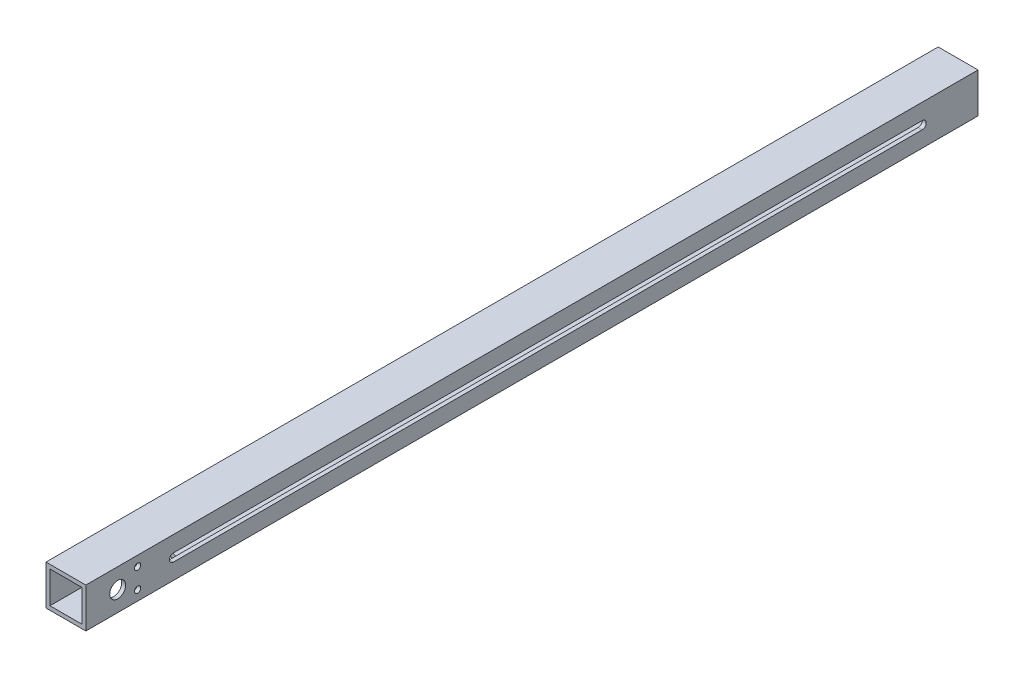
ISO-10303-21;
HEADER;
FILE_DESCRIPTION(('STEP AP214'),'2;1');
FILE_NAME('part.step','',(''),(''),'','','');
FILE_SCHEMA(('AUTOMOTIVE_DESIGN { 1 0 10303 214 1 1 1 1 }'));
ENDSEC;
DATA;
#1=APPLICATION_CONTEXT('core data for automotive mechanical design processes');
#2=APPLICATION_PROTOCOL_DEFINITION('international standard','automotive_design',2000,#1);
#3=PRODUCT_CONTEXT('',#1,'mechanical');
#4=PRODUCT('Part','Part','',(#3));
#5=PRODUCT_RELATED_PRODUCT_CATEGORY('part','',(#4));
#6=PRODUCT_DEFINITION_FORMATION('','',#4);
#7=PRODUCT_DEFINITION_CONTEXT('part definition',#1,'design');
#8=PRODUCT_DEFINITION('design','',#6,#7);
#9=PRODUCT_DEFINITION_SHAPE('','',#8);
#10=(LENGTH_UNIT() NAMED_UNIT(*) SI_UNIT(.MILLI.,.METRE.));
#11=(NAMED_UNIT(*) PLANE_ANGLE_UNIT() SI_UNIT($,.RADIAN.));
#12=(NAMED_UNIT(*) SI_UNIT($,.STERADIAN.) SOLID_ANGLE_UNIT());
#13=UNCERTAINTY_MEASURE_WITH_UNIT(LENGTH_MEASURE(1.E-05),#10,'distance_accuracy_value','');
#14=(GEOMETRIC_REPRESENTATION_CONTEXT(3) GLOBAL_UNCERTAINTY_ASSIGNED_CONTEXT((#13)) GLOBAL_UNIT_ASSIGNED_CONTEXT((#10,
#11,#12)) REPRESENTATION_CONTEXT('',''));
#15=CARTESIAN_POINT('',(0.,0.,0.));
#16=DIRECTION('',(0.,0.,1.));
#17=DIRECTION('',(1.,0.,0.));
#18=AXIS2_PLACEMENT_3D('',#15,#16,#17);
#19=CARTESIAN_POINT('',(-15.875,-15.875,-711.2));
#20=DIRECTION('',(-1.,0.,0.));
#21=DIRECTION('',(0.,0.,1.));
#22=AXIS2_PLACEMENT_3D('',#19,#20,#21);
#23=PLANE('',#22);
#24=DIRECTION('',(0.,0.,-1.));
#25=VECTOR('',#24,1.);
#26=CARTESIAN_POINT('',(-15.875,12.7,-711.2));
#27=LINE('',#26,#25);
#28=CARTESIAN_POINT('',(-15.875,12.7,-628.65));
#29=VERTEX_POINT('',#28);
#30=CARTESIAN_POINT('',(-15.875,12.7,-711.2));
#31=VERTEX_POINT('',#30);
#32=EDGE_CURVE('E276',#29,#31,#27,.T.);
#33=ORIENTED_EDGE('',*,*,#32,.F.);
#34=CARTESIAN_POINT('',(-15.875,6.35,-628.65));
#35=DIRECTION('',(-1.,0.,0.));
#36=DIRECTION('',(0.,0.,1.));
#37=AXIS2_PLACEMENT_3D('',#34,#35,#36);
#38=CIRCLE('',#37,6.35);
#39=CARTESIAN_POINT('',(-15.875,6.35,-622.3));
#40=VERTEX_POINT('',#39);
#41=EDGE_CURVE('E472',#29,#40,#38,.F.);
#42=ORIENTED_EDGE('',*,*,#41,.T.);
#43=DIRECTION('',(0.,1.,0.));
#44=VECTOR('',#43,1.);
#45=CARTESIAN_POINT('',(-15.875,12.7,-622.3));
#46=LINE('',#45,#44);
#47=CARTESIAN_POINT('',(-15.875,-6.35,-622.3));
#48=VERTEX_POINT('',#47);
#49=EDGE_CURVE('E279',#48,#40,#46,.T.);
#50=ORIENTED_EDGE('',*,*,#49,.F.);
#51=CARTESIAN_POINT('',(-15.875,-6.35,-628.65));
#52=DIRECTION('',(-1.,0.,0.));
#53=DIRECTION('',(0.,0.,1.));
#54=AXIS2_PLACEMENT_3D('',#51,#52,#53);
#55=CIRCLE('',#54,6.35);
#56=CARTESIAN_POINT('',(-15.875,-12.7,-628.65));
#57=VERTEX_POINT('',#56);
#58=EDGE_CURVE('E47',#48,#57,#55,.F.);
#59=ORIENTED_EDGE('',*,*,#58,.T.);
#60=DIRECTION('',(0.,0.,1.));
#61=VECTOR('',#60,1.);
#62=CARTESIAN_POINT('',(-15.875,-12.7,-711.2));
#63=LINE('',#62,#61);
#64=CARTESIAN_POINT('',(-15.875,-12.7,-711.2));
#65=VERTEX_POINT('',#64);
#66=EDGE_CURVE('E237',#65,#57,#63,.T.);
#67=ORIENTED_EDGE('',*,*,#66,.F.);
#68=DIRECTION('',(0.,-1.,0.));
#69=VECTOR('',#68,1.);
#70=CARTESIAN_POINT('',(-15.875,-15.875,-711.2));
#71=LINE('',#70,#69);
#72=CARTESIAN_POINT('',(-15.875,-15.875,-711.2));
#73=VERTEX_POINT('',#72);
#74=EDGE_CURVE('E410',#65,#73,#71,.T.);
#75=ORIENTED_EDGE('',*,*,#74,.T.);
#76=DIRECTION('',(0.,0.,1.));
#77=VECTOR('',#76,1.);
#78=CARTESIAN_POINT('',(-15.875,-15.875,-711.2));
#79=LINE('',#78,#77);
#80=CARTESIAN_POINT('',(-15.875,-15.875,0.));
#81=VERTEX_POINT('',#80);
#82=EDGE_CURVE('E422',#73,#81,#79,.T.);
#83=ORIENTED_EDGE('',*,*,#82,.T.);
#84=DIRECTION('',(0.,-1.,0.));
#85=VECTOR('',#84,1.);
#86=CARTESIAN_POINT('',(-15.875,-15.875,0.));
#87=LINE('',#86,#85);
#88=CARTESIAN_POINT('',(-15.875,15.875,0.));
#89=VERTEX_POINT('',#88);
#90=EDGE_CURVE('E396',#89,#81,#87,.T.);
#91=ORIENTED_EDGE('',*,*,#90,.F.);
#92=DIRECTION('',(0.,0.,1.));
#93=VECTOR('',#92,1.);
#94=CARTESIAN_POINT('',(-15.875,15.875,-711.2));
#95=LINE('',#94,#93);
#96=CARTESIAN_POINT('',(-15.875,15.875,-711.2));
#97=VERTEX_POINT('',#96);
#98=EDGE_CURVE('E438',#97,#89,#95,.T.);
#99=ORIENTED_EDGE('',*,*,#98,.F.);
#100=EDGE_CURVE('E405',#97,#31,#71,.T.);
#101=ORIENTED_EDGE('',*,*,#100,.T.);
#102=EDGE_LOOP('',(#33,#42,#50,#59,#67,#75,#83,#91,#99,#101));
#103=FACE_BOUND('',#102,.T.);
#104=CARTESIAN_POINT('',(-15.875,-7.9375,-41.275));
#105=DIRECTION('',(1.,0.,0.));
#106=DIRECTION('',(0.,1.,0.));
#107=AXIS2_PLACEMENT_3D('',#104,#105,#106);
#108=CIRCLE('',#107,2.4892);
#109=CARTESIAN_POINT('',(-15.875,-5.4483,-41.275));
#110=VERTEX_POINT('',#109);
#111=EDGE_CURVE('E329',#110,#110,#108,.T.);
#112=ORIENTED_EDGE('',*,*,#111,.T.);
#113=EDGE_LOOP('',(#112));
#114=FACE_BOUND('',#113,.T.);
#115=CARTESIAN_POINT('',(-15.875,7.9375,-41.275));
#116=DIRECTION('',(1.,0.,0.));
#117=DIRECTION('',(0.,1.,0.));
#118=AXIS2_PLACEMENT_3D('',#115,#116,#117);
#119=CIRCLE('',#118,2.4892);
#120=CARTESIAN_POINT('',(-15.875,10.4267,-41.275));
#121=VERTEX_POINT('',#120);
#122=EDGE_CURVE('E342',#121,#121,#119,.T.);
#123=ORIENTED_EDGE('',*,*,#122,.T.);
#124=EDGE_LOOP('',(#123));
#125=FACE_BOUND('',#124,.T.);
#126=CARTESIAN_POINT('',(-15.875,0.,-25.4));
#127=DIRECTION('',(1.,0.,0.));
#128=DIRECTION('',(0.,1.,0.));
#129=AXIS2_PLACEMENT_3D('',#126,#127,#128);
#130=CIRCLE('',#129,6.35);
#131=CARTESIAN_POINT('',(-15.875,6.35,-25.4));
#132=VERTEX_POINT('',#131);
#133=EDGE_CURVE('E355',#132,#132,#130,.T.);
#134=ORIENTED_EDGE('',*,*,#133,.T.);
#135=EDGE_LOOP('',(#134));
#136=FACE_BOUND('',#135,.T.);
#137=ADVANCED_FACE('F38',(#103,#114,#125,#136),#23,.T.);
#138=CARTESIAN_POINT('',(-15.875,15.875,-711.2));
#139=DIRECTION('',(0.,1.,0.));
#140=DIRECTION('',(0.,0.,1.));
#141=AXIS2_PLACEMENT_3D('',#138,#139,#140);
#142=PLANE('',#141);
#143=DIRECTION('',(-1.,0.,0.));
#144=VECTOR('',#143,1.);
#145=CARTESIAN_POINT('',(-15.875,15.875,0.));
#146=LINE('',#145,#144);
#147=CARTESIAN_POINT('',(15.875,15.875,0.));
#148=VERTEX_POINT('',#147);
#149=EDGE_CURVE('E434',#148,#89,#146,.T.);
#150=ORIENTED_EDGE('',*,*,#149,.F.);
#151=DIRECTION('',(0.,0.,1.));
#152=VECTOR('',#151,1.);
#153=CARTESIAN_POINT('',(15.875,15.875,-711.2));
#154=LINE('',#153,#152);
#155=CARTESIAN_POINT('',(15.875,15.875,-711.2));
#156=VERTEX_POINT('',#155);
#157=EDGE_CURVE('E442',#156,#148,#154,.T.);
#158=ORIENTED_EDGE('',*,*,#157,.F.);
#159=DIRECTION('',(-1.,0.,0.));
#160=VECTOR('',#159,1.);
#161=CARTESIAN_POINT('',(-15.875,15.875,-711.2));
#162=LINE('',#161,#160);
#163=EDGE_CURVE('E418',#156,#97,#162,.T.);
#164=ORIENTED_EDGE('',*,*,#163,.T.);
#165=ORIENTED_EDGE('',*,*,#98,.T.);
#166=EDGE_LOOP('',(#150,#158,#164,#165));
#167=FACE_BOUND('',#166,.T.);
#168=ADVANCED_FACE('F511',(#167),#142,.T.);
#169=CARTESIAN_POINT('',(15.875,-15.875,-711.2));
#170=DIRECTION('',(1.,0.,0.));
#171=DIRECTION('',(0.,1.,0.));
#172=AXIS2_PLACEMENT_3D('',#169,#170,#171);
#173=PLANE('',#172);
#174=CARTESIAN_POINT('',(15.875,0.,-69.85));
#175=DIRECTION('',(1.,0.,0.));
#176=DIRECTION('',(0.,1.,0.));
#177=AXIS2_PLACEMENT_3D('',#174,#175,#176);
#178=CIRCLE('',#177,3.175);
#179=CARTESIAN_POINT('',(15.875,3.175,-69.85));
#180=VERTEX_POINT('',#179);
#181=CARTESIAN_POINT('',(15.875,-3.175,-69.85));
#182=VERTEX_POINT('',#181);
#183=EDGE_CURVE('E275',#180,#182,#178,.T.);
#184=ORIENTED_EDGE('',*,*,#183,.F.);
#185=DIRECTION('',(0.,0.,1.));
#186=VECTOR('',#185,1.);
#187=CARTESIAN_POINT('',(15.875,3.175,-69.85));
#188=LINE('',#187,#186);
#189=CARTESIAN_POINT('',(15.875,3.175,-666.75));
#190=VERTEX_POINT('',#189);
#191=EDGE_CURVE('E290',#190,#180,#188,.T.);
#192=ORIENTED_EDGE('',*,*,#191,.F.);
#193=CARTESIAN_POINT('',(15.875,0.,-666.75));
#194=DIRECTION('',(1.,0.,0.));
#195=DIRECTION('',(0.,1.,0.));
#196=AXIS2_PLACEMENT_3D('',#193,#194,#195);
#197=CIRCLE('',#196,3.175);
#198=CARTESIAN_POINT('',(15.875,-3.175,-666.75));
#199=VERTEX_POINT('',#198);
#200=EDGE_CURVE('E309',#199,#190,#197,.T.);
#201=ORIENTED_EDGE('',*,*,#200,.F.);
#202=DIRECTION('',(0.,0.,-1.));
#203=VECTOR('',#202,1.);
#204=CARTESIAN_POINT('',(15.875,-3.175,-69.85));
#205=LINE('',#204,#203);
#206=EDGE_CURVE('E305',#182,#199,#205,.T.);
#207=ORIENTED_EDGE('',*,*,#206,.F.);
#208=EDGE_LOOP('',(#184,#192,#201,#207));
#209=FACE_BOUND('',#208,.T.);
#210=CARTESIAN_POINT('',(15.875,-7.9375,-41.275));
#211=DIRECTION('',(1.,0.,0.));
#212=DIRECTION('',(0.,1.,0.));
#213=AXIS2_PLACEMENT_3D('',#210,#211,#212);
#214=CIRCLE('',#213,2.4892);
#215=CARTESIAN_POINT('',(15.875,-5.44830000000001,-41.275));
#216=VERTEX_POINT('',#215);
#217=EDGE_CURVE('E319',#216,#216,#214,.T.);
#218=ORIENTED_EDGE('',*,*,#217,.F.);
#219=EDGE_LOOP('',(#218));
#220=FACE_BOUND('',#219,.T.);
#221=CARTESIAN_POINT('',(15.875,7.9375,-41.275));
#222=DIRECTION('',(1.,0.,0.));
#223=DIRECTION('',(0.,1.,0.));
#224=AXIS2_PLACEMENT_3D('',#221,#222,#223);
#225=CIRCLE('',#224,2.4892);
#226=CARTESIAN_POINT('',(15.875,10.4267,-41.275));
#227=VERTEX_POINT('',#226);
#228=EDGE_CURVE('E341',#227,#227,#225,.T.);
#229=ORIENTED_EDGE('',*,*,#228,.F.);
#230=EDGE_LOOP('',(#229));
#231=FACE_BOUND('',#230,.T.);
#232=CARTESIAN_POINT('',(15.875,0.,-25.4));
#233=DIRECTION('',(1.,0.,0.));
#234=DIRECTION('',(0.,1.,0.));
#235=AXIS2_PLACEMENT_3D('',#232,#233,#234);
#236=CIRCLE('',#235,6.35);
#237=CARTESIAN_POINT('',(15.875,6.35,-25.4));
#238=VERTEX_POINT('',#237);
#239=EDGE_CURVE('E354',#238,#238,#236,.T.);
#240=ORIENTED_EDGE('',*,*,#239,.F.);
#241=EDGE_LOOP('',(#240));
#242=FACE_BOUND('',#241,.T.);
#243=DIRECTION('',(0.,1.,0.));
#244=VECTOR('',#243,1.);
#245=CARTESIAN_POINT('',(15.875,-15.875,0.));
#246=LINE('',#245,#244);
#247=CARTESIAN_POINT('',(15.875,-15.875,0.));
#248=VERTEX_POINT('',#247);
#249=EDGE_CURVE('E430',#248,#148,#246,.T.);
#250=ORIENTED_EDGE('',*,*,#249,.F.);
#251=DIRECTION('',(0.,0.,1.));
#252=VECTOR('',#251,1.);
#253=CARTESIAN_POINT('',(15.875,-15.875,-711.2));
#254=LINE('',#253,#252);
#255=CARTESIAN_POINT('',(15.875,-15.875,-711.2));
#256=VERTEX_POINT('',#255);
#257=EDGE_CURVE('E445',#256,#248,#254,.T.);
#258=ORIENTED_EDGE('',*,*,#257,.F.);
#259=DIRECTION('',(0.,1.,0.));
#260=VECTOR('',#259,1.);
#261=CARTESIAN_POINT('',(15.875,-15.875,-711.2));
#262=LINE('',#261,#260);
#263=EDGE_CURVE('E414',#256,#156,#262,.T.);
#264=ORIENTED_EDGE('',*,*,#263,.T.);
#265=ORIENTED_EDGE('',*,*,#157,.T.);
#266=EDGE_LOOP('',(#250,#258,#264,#265));
#267=FACE_BOUND('',#266,.T.);
#268=ADVANCED_FACE('F492',(#209,#220,#231,#242,#267),#173,.T.);
#269=CARTESIAN_POINT('',(-15.875,-15.875,-711.2));
#270=DIRECTION('',(0.,-1.,0.));
#271=DIRECTION('',(0.,0.,-1.));
#272=AXIS2_PLACEMENT_3D('',#269,#270,#271);
#273=PLANE('',#272);
#274=CARTESIAN_POINT('',(0.,-15.875,-25.4));
#275=DIRECTION('',(0.,-1.,0.));
#276=DIRECTION('',(0.,0.,-1.));
#277=AXIS2_PLACEMENT_3D('',#274,#275,#276);
#278=CIRCLE('',#277,8.89);
#279=CARTESIAN_POINT('',(8.89,-15.875,-25.4));
#280=VERTEX_POINT('',#279);
#281=CARTESIAN_POINT('',(-8.89,-15.875,-25.4));
#282=VERTEX_POINT('',#281);
#283=EDGE_CURVE('E222',#280,#282,#278,.T.);
#284=ORIENTED_EDGE('',*,*,#283,.F.);
#285=DIRECTION('',(0.,0.,1.));
#286=VECTOR('',#285,1.);
#287=CARTESIAN_POINT('',(8.89,-15.875,-25.4));
#288=LINE('',#287,#286);
#289=CARTESIAN_POINT('',(8.89000000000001,-15.875,-76.2));
#290=VERTEX_POINT('',#289);
#291=EDGE_CURVE('E228',#290,#280,#288,.T.);
#292=ORIENTED_EDGE('',*,*,#291,.F.);
#293=CARTESIAN_POINT('',(0.,-15.875,-76.2));
#294=DIRECTION('',(0.,-1.,0.));
#295=DIRECTION('',(0.,0.,-1.));
#296=AXIS2_PLACEMENT_3D('',#293,#294,#295);
#297=CIRCLE('',#296,8.89);
#298=CARTESIAN_POINT('',(-8.88999999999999,-15.875,-76.2));
#299=VERTEX_POINT('',#298);
#300=EDGE_CURVE('E257',#299,#290,#297,.T.);
#301=ORIENTED_EDGE('',*,*,#300,.F.);
#302=DIRECTION('',(0.,0.,-1.));
#303=VECTOR('',#302,1.);
#304=CARTESIAN_POINT('',(-8.89,-15.875,-25.4));
#305=LINE('',#304,#303);
#306=EDGE_CURVE('E248',#282,#299,#305,.T.);
#307=ORIENTED_EDGE('',*,*,#306,.F.);
#308=EDGE_LOOP('',(#284,#292,#301,#307));
#309=FACE_BOUND('',#308,.T.);
#310=DIRECTION('',(1.,0.,0.));
#311=VECTOR('',#310,1.);
#312=CARTESIAN_POINT('',(-15.875,-15.875,0.));
#313=LINE('',#312,#311);
#314=EDGE_CURVE('E426',#81,#248,#313,.T.);
#315=ORIENTED_EDGE('',*,*,#314,.F.);
#316=ORIENTED_EDGE('',*,*,#82,.F.);
#317=DIRECTION('',(1.,0.,0.));
#318=VECTOR('',#317,1.);
#319=CARTESIAN_POINT('',(-15.875,-15.875,-711.2));
#320=LINE('',#319,#318);
#321=EDGE_CURVE('E409',#73,#256,#320,.T.);
#322=ORIENTED_EDGE('',*,*,#321,.T.);
#323=ORIENTED_EDGE('',*,*,#257,.T.);
#324=EDGE_LOOP('',(#315,#316,#322,#323));
#325=FACE_BOUND('',#324,.T.);
#326=ADVANCED_FACE('F488',(#309,#325),#273,.T.);
#327=CARTESIAN_POINT('',(0.,0.,-711.2));
#328=DIRECTION('',(0.,0.,-1.));
#329=DIRECTION('',(-1.,0.,0.));
#330=AXIS2_PLACEMENT_3D('',#327,#328,#329);
#331=PLANE('',#330);
#332=DIRECTION('',(-1.,0.,0.));
#333=VECTOR('',#332,1.);
#334=CARTESIAN_POINT('',(-12.7,12.7,-711.2));
#335=LINE('',#334,#333);
#336=CARTESIAN_POINT('',(12.7,12.7,-711.2));
#337=VERTEX_POINT('',#336);
#338=EDGE_CURVE('E371',#337,#31,#335,.T.);
#339=ORIENTED_EDGE('',*,*,#338,.T.);
#340=ORIENTED_EDGE('',*,*,#100,.F.);
#341=ORIENTED_EDGE('',*,*,#163,.F.);
#342=ORIENTED_EDGE('',*,*,#263,.F.);
#343=ORIENTED_EDGE('',*,*,#321,.F.);
#344=ORIENTED_EDGE('',*,*,#74,.F.);
#345=DIRECTION('',(1.,0.,0.));
#346=VECTOR('',#345,1.);
#347=CARTESIAN_POINT('',(-12.7,-12.7,-711.2));
#348=LINE('',#347,#346);
#349=CARTESIAN_POINT('',(12.7,-12.7,-711.2));
#350=VERTEX_POINT('',#349);
#351=EDGE_CURVE('E376',#65,#350,#348,.T.);
#352=ORIENTED_EDGE('',*,*,#351,.T.);
#353=DIRECTION('',(0.,1.,0.));
#354=VECTOR('',#353,1.);
#355=CARTESIAN_POINT('',(12.7,-12.7,-711.2));
#356=LINE('',#355,#354);
#357=EDGE_CURVE('E367',#350,#337,#356,.T.);
#358=ORIENTED_EDGE('',*,*,#357,.T.);
#359=EDGE_LOOP('',(#339,#340,#341,#342,#343,#344,#352,#358));
#360=FACE_BOUND('',#359,.T.);
#361=ADVANCED_FACE('F491',(#360),#331,.T.);
#362=CARTESIAN_POINT('',(0.,0.,0.));
#363=DIRECTION('',(0.,0.,-1.));
#364=DIRECTION('',(-1.,0.,0.));
#365=AXIS2_PLACEMENT_3D('',#362,#363,#364);
#366=PLANE('',#365);
#367=DIRECTION('',(-1.,0.,0.));
#368=VECTOR('',#367,1.);
#369=CARTESIAN_POINT('',(-12.7,12.7,0.));
#370=LINE('',#369,#368);
#371=CARTESIAN_POINT('',(12.7,12.7,0.));
#372=VERTEX_POINT('',#371);
#373=CARTESIAN_POINT('',(-12.7,12.7,0.));
#374=VERTEX_POINT('',#373);
#375=EDGE_CURVE('E383',#372,#374,#370,.T.);
#376=ORIENTED_EDGE('',*,*,#375,.F.);
#377=DIRECTION('',(0.,1.,0.));
#378=VECTOR('',#377,1.);
#379=CARTESIAN_POINT('',(12.7,-12.7,0.));
#380=LINE('',#379,#378);
#381=CARTESIAN_POINT('',(12.7,-12.7,0.));
#382=VERTEX_POINT('',#381);
#383=EDGE_CURVE('E366',#382,#372,#380,.T.);
#384=ORIENTED_EDGE('',*,*,#383,.F.);
#385=DIRECTION('',(1.,0.,0.));
#386=VECTOR('',#385,1.);
#387=CARTESIAN_POINT('',(-12.7,-12.7,0.));
#388=LINE('',#387,#386);
#389=CARTESIAN_POINT('',(-12.7,-12.7,0.));
#390=VERTEX_POINT('',#389);
#391=EDGE_CURVE('E372',#390,#382,#388,.T.);
#392=ORIENTED_EDGE('',*,*,#391,.F.);
#393=DIRECTION('',(0.,-1.,0.));
#394=VECTOR('',#393,1.);
#395=CARTESIAN_POINT('',(-12.7,-12.7,0.));
#396=LINE('',#395,#394);
#397=EDGE_CURVE('E387',#374,#390,#396,.T.);
#398=ORIENTED_EDGE('',*,*,#397,.F.);
#399=EDGE_LOOP('',(#376,#384,#392,#398));
#400=FACE_BOUND('',#399,.T.);
#401=ORIENTED_EDGE('',*,*,#90,.T.);
#402=ORIENTED_EDGE('',*,*,#314,.T.);
#403=ORIENTED_EDGE('',*,*,#249,.T.);
#404=ORIENTED_EDGE('',*,*,#149,.T.);
#405=EDGE_LOOP('',(#401,#402,#403,#404));
#406=FACE_BOUND('',#405,.T.);
#407=ADVANCED_FACE('F500',(#400,#406),#366,.F.);
#408=CARTESIAN_POINT('',(12.7,-12.7,-711.2));
#409=DIRECTION('',(1.,0.,0.));
#410=DIRECTION('',(0.,0.,-1.));
#411=AXIS2_PLACEMENT_3D('',#408,#409,#410);
#412=PLANE('',#411);
#413=DIRECTION('',(0.,0.,1.));
#414=VECTOR('',#413,1.);
#415=CARTESIAN_POINT('',(12.7,3.175,-69.85));
#416=LINE('',#415,#414);
#417=CARTESIAN_POINT('',(12.7,3.175,-666.75));
#418=VERTEX_POINT('',#417);
#419=CARTESIAN_POINT('',(12.7,3.175,-69.85));
#420=VERTEX_POINT('',#419);
#421=EDGE_CURVE('E298',#418,#420,#416,.T.);
#422=ORIENTED_EDGE('',*,*,#421,.T.);
#423=CARTESIAN_POINT('',(12.7,0.,-69.85));
#424=DIRECTION('',(1.,0.,0.));
#425=DIRECTION('',(0.,1.,0.));
#426=AXIS2_PLACEMENT_3D('',#423,#424,#425);
#427=CIRCLE('',#426,3.175);
#428=CARTESIAN_POINT('',(12.7,-3.175,-69.85));
#429=VERTEX_POINT('',#428);
#430=EDGE_CURVE('E285',#420,#429,#427,.T.);
#431=ORIENTED_EDGE('',*,*,#430,.T.);
#432=DIRECTION('',(0.,0.,-1.));
#433=VECTOR('',#432,1.);
#434=CARTESIAN_POINT('',(12.7,-3.175,-69.85));
#435=LINE('',#434,#433);
#436=CARTESIAN_POINT('',(12.7,-3.175,-666.75));
#437=VERTEX_POINT('',#436);
#438=EDGE_CURVE('E289',#429,#437,#435,.T.);
#439=ORIENTED_EDGE('',*,*,#438,.T.);
#440=CARTESIAN_POINT('',(12.7,0.,-666.75));
#441=DIRECTION('',(1.,0.,0.));
#442=DIRECTION('',(0.,1.,0.));
#443=AXIS2_PLACEMENT_3D('',#440,#441,#442);
#444=CIRCLE('',#443,3.175);
#445=EDGE_CURVE('E294',#437,#418,#444,.T.);
#446=ORIENTED_EDGE('',*,*,#445,.T.);
#447=EDGE_LOOP('',(#422,#431,#439,#446));
#448=FACE_BOUND('',#447,.T.);
#449=CARTESIAN_POINT('',(12.7,-7.9375,-41.275));
#450=DIRECTION('',(1.,0.,0.));
#451=DIRECTION('',(0.,0.,-1.));
#452=AXIS2_PLACEMENT_3D('',#449,#450,#451);
#453=CIRCLE('',#452,2.4892);
#454=CARTESIAN_POINT('',(12.7,-7.9375,-43.7642));
#455=VERTEX_POINT('',#454);
#456=EDGE_CURVE('E337',#455,#455,#453,.T.);
#457=ORIENTED_EDGE('',*,*,#456,.T.);
#458=EDGE_LOOP('',(#457));
#459=FACE_BOUND('',#458,.T.);
#460=CARTESIAN_POINT('',(12.7,7.9375,-41.275));
#461=DIRECTION('',(1.,0.,0.));
#462=DIRECTION('',(0.,0.,-1.));
#463=AXIS2_PLACEMENT_3D('',#460,#461,#462);
#464=CIRCLE('',#463,2.4892);
#465=CARTESIAN_POINT('',(12.7,7.9375,-43.7642));
#466=VERTEX_POINT('',#465);
#467=EDGE_CURVE('E350',#466,#466,#464,.T.);
#468=ORIENTED_EDGE('',*,*,#467,.T.);
#469=EDGE_LOOP('',(#468));
#470=FACE_BOUND('',#469,.T.);
#471=CARTESIAN_POINT('',(12.7,0.,-25.4));
#472=DIRECTION('',(1.,0.,0.));
#473=DIRECTION('',(0.,0.,-1.));
#474=AXIS2_PLACEMENT_3D('',#471,#472,#473);
#475=CIRCLE('',#474,6.35);
#476=CARTESIAN_POINT('',(12.7,0.,-31.75));
#477=VERTEX_POINT('',#476);
#478=EDGE_CURVE('E362',#477,#477,#475,.T.);
#479=ORIENTED_EDGE('',*,*,#478,.T.);
#480=EDGE_LOOP('',(#479));
#481=FACE_BOUND('',#480,.T.);
#482=ORIENTED_EDGE('',*,*,#383,.T.);
#483=DIRECTION('',(0.,0.,1.));
#484=VECTOR('',#483,1.);
#485=CARTESIAN_POINT('',(12.7,12.7,-711.2));
#486=LINE('',#485,#484);
#487=EDGE_CURVE('E380',#337,#372,#486,.T.);
#488=ORIENTED_EDGE('',*,*,#487,.F.);
#489=ORIENTED_EDGE('',*,*,#357,.F.);
#490=DIRECTION('',(0.,0.,1.));
#491=VECTOR('',#490,1.);
#492=CARTESIAN_POINT('',(12.7,-12.7,-711.2));
#493=LINE('',#492,#491);
#494=EDGE_CURVE('E393',#350,#382,#493,.T.);
#495=ORIENTED_EDGE('',*,*,#494,.T.);
#496=EDGE_LOOP('',(#482,#488,#489,#495));
#497=FACE_BOUND('',#496,.T.);
#498=ADVANCED_FACE('F546',(#448,#459,#470,#481,#497),#412,.F.);
#499=CARTESIAN_POINT('',(-12.7,-12.7,-711.2));
#500=DIRECTION('',(0.,-1.,0.));
#501=DIRECTION('',(0.,0.,-1.));
#502=AXIS2_PLACEMENT_3D('',#499,#500,#501);
#503=PLANE('',#502);
#504=DIRECTION('',(0.,0.,-1.));
#505=VECTOR('',#504,1.);
#506=CARTESIAN_POINT('',(8.89,-12.7,-25.4));
#507=LINE('',#506,#505);
#508=CARTESIAN_POINT('',(8.89,-12.7,-25.4));
#509=VERTEX_POINT('',#508);
#510=CARTESIAN_POINT('',(8.89000000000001,-12.7,-76.2));
#511=VERTEX_POINT('',#510);
#512=EDGE_CURVE('E243',#509,#511,#507,.T.);
#513=ORIENTED_EDGE('',*,*,#512,.F.);
#514=CARTESIAN_POINT('',(0.,-12.7,-25.4));
#515=DIRECTION('',(0.,-1.,0.));
#516=DIRECTION('',(0.,0.,-1.));
#517=AXIS2_PLACEMENT_3D('',#514,#515,#516);
#518=CIRCLE('',#517,8.89);
#519=CARTESIAN_POINT('',(-8.89,-12.7,-25.4));
#520=VERTEX_POINT('',#519);
#521=EDGE_CURVE('E219',#520,#509,#518,.F.);
#522=ORIENTED_EDGE('',*,*,#521,.F.);
#523=DIRECTION('',(0.,0.,1.));
#524=VECTOR('',#523,1.);
#525=CARTESIAN_POINT('',(-8.89,-12.7,-25.4));
#526=LINE('',#525,#524);
#527=CARTESIAN_POINT('',(-8.88999999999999,-12.7,-76.1999999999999));
#528=VERTEX_POINT('',#527);
#529=EDGE_CURVE('E232',#528,#520,#526,.T.);
#530=ORIENTED_EDGE('',*,*,#529,.F.);
#531=CARTESIAN_POINT('',(0.,-12.7,-76.2));
#532=DIRECTION('',(0.,-1.,0.));
#533=DIRECTION('',(0.,0.,-1.));
#534=AXIS2_PLACEMENT_3D('',#531,#532,#533);
#535=CIRCLE('',#534,8.89);
#536=EDGE_CURVE('E251',#511,#528,#535,.F.);
#537=ORIENTED_EDGE('',*,*,#536,.F.);
#538=EDGE_LOOP('',(#513,#522,#530,#537));
#539=FACE_BOUND('',#538,.T.);
#540=ORIENTED_EDGE('',*,*,#66,.T.);
#541=DIRECTION('',(-1.,0.,0.));
#542=VECTOR('',#541,1.);
#543=CARTESIAN_POINT('',(-12.7,-12.7,-628.65));
#544=LINE('',#543,#542);
#545=CARTESIAN_POINT('',(-12.7,-12.7,-628.65));
#546=VERTEX_POINT('',#545);
#547=EDGE_CURVE('E469',#57,#546,#544,.F.);
#548=ORIENTED_EDGE('',*,*,#547,.T.);
#549=DIRECTION('',(0.,0.,1.));
#550=VECTOR('',#549,1.);
#551=CARTESIAN_POINT('',(-12.7,-12.7,-711.2));
#552=LINE('',#551,#550);
#553=EDGE_CURVE('E56',#546,#390,#552,.T.);
#554=ORIENTED_EDGE('',*,*,#553,.T.);
#555=ORIENTED_EDGE('',*,*,#391,.T.);
#556=ORIENTED_EDGE('',*,*,#494,.F.);
#557=ORIENTED_EDGE('',*,*,#351,.F.);
#558=EDGE_LOOP('',(#540,#548,#554,#555,#556,#557));
#559=FACE_BOUND('',#558,.T.);
#560=ADVANCED_FACE('F240',(#539,#559),#503,.F.);
#561=CARTESIAN_POINT('',(-12.7,-12.7,-711.2));
#562=DIRECTION('',(-1.,0.,0.));
#563=DIRECTION('',(0.,0.,1.));
#564=AXIS2_PLACEMENT_3D('',#561,#562,#563);
#565=PLANE('',#564);
#566=CARTESIAN_POINT('',(-12.7,-7.9375,-41.275));
#567=DIRECTION('',(-1.,0.,0.));
#568=DIRECTION('',(0.,0.,1.));
#569=AXIS2_PLACEMENT_3D('',#566,#567,#568);
#570=CIRCLE('',#569,2.4892);
#571=CARTESIAN_POINT('',(-12.7,-7.9375,-38.7858));
#572=VERTEX_POINT('',#571);
#573=EDGE_CURVE('E333',#572,#572,#570,.T.);
#574=ORIENTED_EDGE('',*,*,#573,.T.);
#575=EDGE_LOOP('',(#574));
#576=FACE_BOUND('',#575,.T.);
#577=CARTESIAN_POINT('',(-12.7,7.9375,-41.275));
#578=DIRECTION('',(-1.,0.,0.));
#579=DIRECTION('',(0.,0.,1.));
#580=AXIS2_PLACEMENT_3D('',#577,#578,#579);
#581=CIRCLE('',#580,2.4892);
#582=CARTESIAN_POINT('',(-12.7,7.9375,-38.7858));
#583=VERTEX_POINT('',#582);
#584=EDGE_CURVE('E346',#583,#583,#581,.T.);
#585=ORIENTED_EDGE('',*,*,#584,.T.);
#586=EDGE_LOOP('',(#585));
#587=FACE_BOUND('',#586,.T.);
#588=CARTESIAN_POINT('',(-12.7,0.,-25.4));
#589=DIRECTION('',(-1.,0.,0.));
#590=DIRECTION('',(0.,0.,1.));
#591=AXIS2_PLACEMENT_3D('',#588,#589,#590);
#592=CIRCLE('',#591,6.35);
#593=CARTESIAN_POINT('',(-12.7,0.,-19.05));
#594=VERTEX_POINT('',#593);
#595=EDGE_CURVE('E358',#594,#594,#592,.T.);
#596=ORIENTED_EDGE('',*,*,#595,.T.);
#597=EDGE_LOOP('',(#596));
#598=FACE_BOUND('',#597,.T.);
#599=ORIENTED_EDGE('',*,*,#553,.F.);
#600=CARTESIAN_POINT('',(-12.7,-6.35,-628.65));
#601=DIRECTION('',(-1.,0.,0.));
#602=DIRECTION('',(0.,0.,1.));
#603=AXIS2_PLACEMENT_3D('',#600,#601,#602);
#604=CIRCLE('',#603,6.35);
#605=CARTESIAN_POINT('',(-12.7,-6.35,-622.3));
#606=VERTEX_POINT('',#605);
#607=EDGE_CURVE('E11',#546,#606,#604,.T.);
#608=ORIENTED_EDGE('',*,*,#607,.T.);
#609=DIRECTION('',(0.,1.,0.));
#610=VECTOR('',#609,1.);
#611=CARTESIAN_POINT('',(-12.7,12.7,-622.3));
#612=LINE('',#611,#610);
#613=CARTESIAN_POINT('',(-12.7,6.35,-622.3));
#614=VERTEX_POINT('',#613);
#615=EDGE_CURVE('E271',#606,#614,#612,.T.);
#616=ORIENTED_EDGE('',*,*,#615,.T.);
#617=CARTESIAN_POINT('',(-12.7,6.35,-628.65));
#618=DIRECTION('',(-1.,0.,0.));
#619=DIRECTION('',(0.,0.,1.));
#620=AXIS2_PLACEMENT_3D('',#617,#618,#619);
#621=CIRCLE('',#620,6.35);
#622=CARTESIAN_POINT('',(-12.7,12.7,-628.65));
#623=VERTEX_POINT('',#622);
#624=EDGE_CURVE('E475',#614,#623,#621,.T.);
#625=ORIENTED_EDGE('',*,*,#624,.T.);
#626=DIRECTION('',(0.,0.,1.));
#627=VECTOR('',#626,1.);
#628=CARTESIAN_POINT('',(-12.7,12.7,-711.2));
#629=LINE('',#628,#627);
#630=EDGE_CURVE('E399',#623,#374,#629,.T.);
#631=ORIENTED_EDGE('',*,*,#630,.T.);
#632=ORIENTED_EDGE('',*,*,#397,.T.);
#633=EDGE_LOOP('',(#599,#608,#616,#625,#631,#632));
#634=FACE_BOUND('',#633,.T.);
#635=ADVANCED_FACE('F535',(#576,#587,#598,#634),#565,.F.);
#636=CARTESIAN_POINT('',(-12.7,12.7,-711.2));
#637=DIRECTION('',(0.,1.,0.));
#638=DIRECTION('',(0.,0.,1.));
#639=AXIS2_PLACEMENT_3D('',#636,#637,#638);
#640=PLANE('',#639);
#641=ORIENTED_EDGE('',*,*,#630,.F.);
#642=DIRECTION('',(-1.,0.,0.));
#643=VECTOR('',#642,1.);
#644=CARTESIAN_POINT('',(-15.875,12.7,-628.65));
#645=LINE('',#644,#643);
#646=EDGE_CURVE('E441',#623,#29,#645,.T.);
#647=ORIENTED_EDGE('',*,*,#646,.T.);
#648=ORIENTED_EDGE('',*,*,#32,.T.);
#649=ORIENTED_EDGE('',*,*,#338,.F.);
#650=ORIENTED_EDGE('',*,*,#487,.T.);
#651=ORIENTED_EDGE('',*,*,#375,.T.);
#652=EDGE_LOOP('',(#641,#647,#648,#649,#650,#651));
#653=FACE_BOUND('',#652,.T.);
#654=ADVANCED_FACE('F549',(#653),#640,.F.);
#655=CARTESIAN_POINT('',(-15.875,0.,-25.4));
#656=DIRECTION('',(1.,0.,0.));
#657=DIRECTION('',(0.,1.,0.));
#658=AXIS2_PLACEMENT_3D('',#655,#656,#657);
#659=CYLINDRICAL_SURFACE('',#658,6.35);
#660=ORIENTED_EDGE('',*,*,#133,.F.);
#661=EDGE_LOOP('',(#660));
#662=FACE_BOUND('',#661,.T.);
#663=ORIENTED_EDGE('',*,*,#595,.F.);
#664=EDGE_LOOP('',(#663));
#665=FACE_BOUND('',#664,.T.);
#666=ADVANCED_FACE('F563',(#662,#665),#659,.F.);
#667=ORIENTED_EDGE('',*,*,#239,.T.);
#668=EDGE_LOOP('',(#667));
#669=FACE_BOUND('',#668,.T.);
#670=ORIENTED_EDGE('',*,*,#478,.F.);
#671=EDGE_LOOP('',(#670));
#672=FACE_BOUND('',#671,.T.);
#673=ADVANCED_FACE('F569',(#669,#672),#659,.F.);
#674=CARTESIAN_POINT('',(-15.875,7.9375,-41.275));
#675=DIRECTION('',(1.,0.,0.));
#676=DIRECTION('',(0.,1.,0.));
#677=AXIS2_PLACEMENT_3D('',#674,#675,#676);
#678=CYLINDRICAL_SURFACE('',#677,2.4892);
#679=ORIENTED_EDGE('',*,*,#122,.F.);
#680=EDGE_LOOP('',(#679));
#681=FACE_BOUND('',#680,.T.);
#682=ORIENTED_EDGE('',*,*,#584,.F.);
#683=EDGE_LOOP('',(#682));
#684=FACE_BOUND('',#683,.T.);
#685=ADVANCED_FACE('F572',(#681,#684),#678,.F.);
#686=ORIENTED_EDGE('',*,*,#228,.T.);
#687=EDGE_LOOP('',(#686));
#688=FACE_BOUND('',#687,.T.);
#689=ORIENTED_EDGE('',*,*,#467,.F.);
#690=EDGE_LOOP('',(#689));
#691=FACE_BOUND('',#690,.T.);
#692=ADVANCED_FACE('F574',(#688,#691),#678,.F.);
#693=CARTESIAN_POINT('',(-15.875,-7.9375,-41.275));
#694=DIRECTION('',(1.,0.,0.));
#695=DIRECTION('',(0.,1.,0.));
#696=AXIS2_PLACEMENT_3D('',#693,#694,#695);
#697=CYLINDRICAL_SURFACE('',#696,2.4892);
#698=ORIENTED_EDGE('',*,*,#111,.F.);
#699=EDGE_LOOP('',(#698));
#700=FACE_BOUND('',#699,.T.);
#701=ORIENTED_EDGE('',*,*,#573,.F.);
#702=EDGE_LOOP('',(#701));
#703=FACE_BOUND('',#702,.T.);
#704=ADVANCED_FACE('F577',(#700,#703),#697,.F.);
#705=ORIENTED_EDGE('',*,*,#217,.T.);
#706=EDGE_LOOP('',(#705));
#707=FACE_BOUND('',#706,.T.);
#708=ORIENTED_EDGE('',*,*,#456,.F.);
#709=EDGE_LOOP('',(#708));
#710=FACE_BOUND('',#709,.T.);
#711=ADVANCED_FACE('F579',(#707,#710),#697,.F.);
#712=CARTESIAN_POINT('',(12.7,0.,-69.85));
#713=DIRECTION('',(1.,0.,0.));
#714=DIRECTION('',(0.,1.,0.));
#715=AXIS2_PLACEMENT_3D('',#712,#713,#714);
#716=CYLINDRICAL_SURFACE('',#715,3.175);
#717=ORIENTED_EDGE('',*,*,#183,.T.);
#718=DIRECTION('',(1.,0.,0.));
#719=VECTOR('',#718,1.);
#720=CARTESIAN_POINT('',(12.7,-3.175,-69.85));
#721=LINE('',#720,#719);
#722=EDGE_CURVE('E302',#429,#182,#721,.T.);
#723=ORIENTED_EDGE('',*,*,#722,.F.);
#724=ORIENTED_EDGE('',*,*,#430,.F.);
#725=DIRECTION('',(1.,0.,0.));
#726=VECTOR('',#725,1.);
#727=CARTESIAN_POINT('',(12.7,3.175,-69.85));
#728=LINE('',#727,#726);
#729=EDGE_CURVE('E316',#420,#180,#728,.T.);
#730=ORIENTED_EDGE('',*,*,#729,.T.);
#731=EDGE_LOOP('',(#717,#723,#724,#730));
#732=FACE_BOUND('',#731,.T.);
#733=ADVANCED_FACE('F582',(#732),#716,.F.);
#734=CARTESIAN_POINT('',(12.7,3.175,-69.85));
#735=DIRECTION('',(0.,1.,0.));
#736=DIRECTION('',(-1.,0.,0.));
#737=AXIS2_PLACEMENT_3D('',#734,#735,#736);
#738=PLANE('',#737);
#739=ORIENTED_EDGE('',*,*,#191,.T.);
#740=ORIENTED_EDGE('',*,*,#729,.F.);
#741=ORIENTED_EDGE('',*,*,#421,.F.);
#742=DIRECTION('',(1.,0.,0.));
#743=VECTOR('',#742,1.);
#744=CARTESIAN_POINT('',(12.7,3.175,-666.75));
#745=LINE('',#744,#743);
#746=EDGE_CURVE('E320',#418,#190,#745,.T.);
#747=ORIENTED_EDGE('',*,*,#746,.T.);
#748=EDGE_LOOP('',(#739,#740,#741,#747));
#749=FACE_BOUND('',#748,.T.);
#750=ADVANCED_FACE('F586',(#749),#738,.F.);
#751=CARTESIAN_POINT('',(12.7,0.,-666.75));
#752=DIRECTION('',(1.,0.,0.));
#753=DIRECTION('',(0.,1.,0.));
#754=AXIS2_PLACEMENT_3D('',#751,#752,#753);
#755=CYLINDRICAL_SURFACE('',#754,3.175);
#756=ORIENTED_EDGE('',*,*,#200,.T.);
#757=ORIENTED_EDGE('',*,*,#746,.F.);
#758=ORIENTED_EDGE('',*,*,#445,.F.);
#759=DIRECTION('',(1.,0.,0.));
#760=VECTOR('',#759,1.);
#761=CARTESIAN_POINT('',(12.7,-3.175,-666.75));
#762=LINE('',#761,#760);
#763=EDGE_CURVE('E323',#437,#199,#762,.T.);
#764=ORIENTED_EDGE('',*,*,#763,.T.);
#765=EDGE_LOOP('',(#756,#757,#758,#764));
#766=FACE_BOUND('',#765,.T.);
#767=ADVANCED_FACE('F590',(#766),#755,.F.);
#768=CARTESIAN_POINT('',(12.7,-3.175,-69.85));
#769=DIRECTION('',(0.,-1.,0.));
#770=DIRECTION('',(1.,0.,0.));
#771=AXIS2_PLACEMENT_3D('',#768,#769,#770);
#772=PLANE('',#771);
#773=ORIENTED_EDGE('',*,*,#206,.T.);
#774=ORIENTED_EDGE('',*,*,#763,.F.);
#775=ORIENTED_EDGE('',*,*,#438,.F.);
#776=ORIENTED_EDGE('',*,*,#722,.T.);
#777=EDGE_LOOP('',(#773,#774,#775,#776));
#778=FACE_BOUND('',#777,.T.);
#779=ADVANCED_FACE('F588',(#778),#772,.F.);
#780=CARTESIAN_POINT('',(-12.7,12.7,-622.3));
#781=DIRECTION('',(0.,0.,1.));
#782=DIRECTION('',(1.,0.,0.));
#783=AXIS2_PLACEMENT_3D('',#780,#781,#782);
#784=PLANE('',#783);
#785=ORIENTED_EDGE('',*,*,#49,.T.);
#786=DIRECTION('',(-1.,0.,0.));
#787=VECTOR('',#786,1.);
#788=CARTESIAN_POINT('',(-12.7,6.35,-622.3));
#789=LINE('',#788,#787);
#790=EDGE_CURVE('E466',#40,#614,#789,.F.);
#791=ORIENTED_EDGE('',*,*,#790,.T.);
#792=ORIENTED_EDGE('',*,*,#615,.F.);
#793=DIRECTION('',(-1.,0.,0.));
#794=VECTOR('',#793,1.);
#795=CARTESIAN_POINT('',(-15.875,-6.35,-622.3));
#796=LINE('',#795,#794);
#797=EDGE_CURVE('E462',#606,#48,#796,.T.);
#798=ORIENTED_EDGE('',*,*,#797,.T.);
#799=EDGE_LOOP('',(#785,#791,#792,#798));
#800=FACE_BOUND('',#799,.T.);
#801=ADVANCED_FACE('F540',(#800),#784,.F.);
#802=CARTESIAN_POINT('',(0.,15.876,-25.4));
#803=DIRECTION('',(0.,-1.,0.));
#804=DIRECTION('',(0.,0.,-1.));
#805=AXIS2_PLACEMENT_3D('',#802,#803,#804);
#806=CYLINDRICAL_SURFACE('',#805,8.89);
#807=ORIENTED_EDGE('',*,*,#521,.T.);
#808=DIRECTION('',(0.,-1.,0.));
#809=VECTOR('',#808,1.);
#810=CARTESIAN_POINT('',(8.89,15.876,-25.4));
#811=LINE('',#810,#809);
#812=EDGE_CURVE('E238',#509,#280,#811,.T.);
#813=ORIENTED_EDGE('',*,*,#812,.T.);
#814=ORIENTED_EDGE('',*,*,#283,.T.);
#815=DIRECTION('',(0.,-1.,0.));
#816=VECTOR('',#815,1.);
#817=CARTESIAN_POINT('',(-8.89,15.876,-25.4));
#818=LINE('',#817,#816);
#819=EDGE_CURVE('E215',#520,#282,#818,.T.);
#820=ORIENTED_EDGE('',*,*,#819,.F.);
#821=EDGE_LOOP('',(#807,#813,#814,#820));
#822=FACE_BOUND('',#821,.T.);
#823=ADVANCED_FACE('F217',(#822),#806,.F.);
#824=CARTESIAN_POINT('',(8.89,15.876,-25.4));
#825=DIRECTION('',(1.,0.,0.));
#826=DIRECTION('',(0.,0.,-1.));
#827=AXIS2_PLACEMENT_3D('',#824,#825,#826);
#828=PLANE('',#827);
#829=ORIENTED_EDGE('',*,*,#512,.T.);
#830=DIRECTION('',(0.,-1.,0.));
#831=VECTOR('',#830,1.);
#832=CARTESIAN_POINT('',(8.89000000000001,15.876,-76.2));
#833=LINE('',#832,#831);
#834=EDGE_CURVE('E266',#511,#290,#833,.T.);
#835=ORIENTED_EDGE('',*,*,#834,.T.);
#836=ORIENTED_EDGE('',*,*,#291,.T.);
#837=ORIENTED_EDGE('',*,*,#812,.F.);
#838=EDGE_LOOP('',(#829,#835,#836,#837));
#839=FACE_BOUND('',#838,.T.);
#840=ADVANCED_FACE('F486',(#839),#828,.F.);
#841=CARTESIAN_POINT('',(0.,15.876,-76.2));
#842=DIRECTION('',(0.,-1.,0.));
#843=DIRECTION('',(0.,0.,-1.));
#844=AXIS2_PLACEMENT_3D('',#841,#842,#843);
#845=CYLINDRICAL_SURFACE('',#844,8.89);
#846=ORIENTED_EDGE('',*,*,#536,.T.);
#847=DIRECTION('',(0.,-1.,0.));
#848=VECTOR('',#847,1.);
#849=CARTESIAN_POINT('',(-8.88999999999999,15.876,-76.2));
#850=LINE('',#849,#848);
#851=EDGE_CURVE('E227',#528,#299,#850,.T.);
#852=ORIENTED_EDGE('',*,*,#851,.T.);
#853=ORIENTED_EDGE('',*,*,#300,.T.);
#854=ORIENTED_EDGE('',*,*,#834,.F.);
#855=EDGE_LOOP('',(#846,#852,#853,#854));
#856=FACE_BOUND('',#855,.T.);
#857=ADVANCED_FACE('F482',(#856),#845,.F.);
#858=CARTESIAN_POINT('',(-8.89,15.876,-25.4));
#859=DIRECTION('',(-1.,0.,0.));
#860=DIRECTION('',(0.,0.,1.));
#861=AXIS2_PLACEMENT_3D('',#858,#859,#860);
#862=PLANE('',#861);
#863=ORIENTED_EDGE('',*,*,#529,.T.);
#864=ORIENTED_EDGE('',*,*,#819,.T.);
#865=ORIENTED_EDGE('',*,*,#306,.T.);
#866=ORIENTED_EDGE('',*,*,#851,.F.);
#867=EDGE_LOOP('',(#863,#864,#865,#866));
#868=FACE_BOUND('',#867,.T.);
#869=ADVANCED_FACE('F233',(#868),#862,.F.);
#870=CARTESIAN_POINT('',(-12.7,6.35,-628.65));
#871=DIRECTION('',(1.,0.,0.));
#872=DIRECTION('',(0.,0.,-1.));
#873=AXIS2_PLACEMENT_3D('',#870,#871,#872);
#874=CYLINDRICAL_SURFACE('',#873,6.35);
#875=ORIENTED_EDGE('',*,*,#624,.F.);
#876=ORIENTED_EDGE('',*,*,#790,.F.);
#877=ORIENTED_EDGE('',*,*,#41,.F.);
#878=ORIENTED_EDGE('',*,*,#646,.F.);
#879=EDGE_LOOP('',(#875,#876,#877,#878));
#880=FACE_BOUND('',#879,.T.);
#881=ADVANCED_FACE('F523',(#880),#874,.F.);
#882=CARTESIAN_POINT('',(-12.7,-6.35,-628.65));
#883=DIRECTION('',(1.,0.,0.));
#884=DIRECTION('',(0.,0.,-1.));
#885=AXIS2_PLACEMENT_3D('',#882,#883,#884);
#886=CYLINDRICAL_SURFACE('',#885,6.35);
#887=ORIENTED_EDGE('',*,*,#607,.F.);
#888=ORIENTED_EDGE('',*,*,#547,.F.);
#889=ORIENTED_EDGE('',*,*,#58,.F.);
#890=ORIENTED_EDGE('',*,*,#797,.F.);
#891=EDGE_LOOP('',(#887,#888,#889,#890));
#892=FACE_BOUND('',#891,.T.);
#893=ADVANCED_FACE('F40',(#892),#886,.F.);
#894=CLOSED_SHELL('',(#137,#168,#268,#326,#361,#407,#498,#560,#635,#654,#666,#673,#685,#692,
#704,#711,#733,#750,#767,#779,#801,#823,#840,#857,#869,#881,#893));
#895=MANIFOLD_SOLID_BREP('B2',#894);
#896=ADVANCED_BREP_SHAPE_REPRESENTATION('',(#18,#895),#14);
#897=SHAPE_DEFINITION_REPRESENTATION(#9,#896);
ENDSEC;
END-ISO-10303-21;
